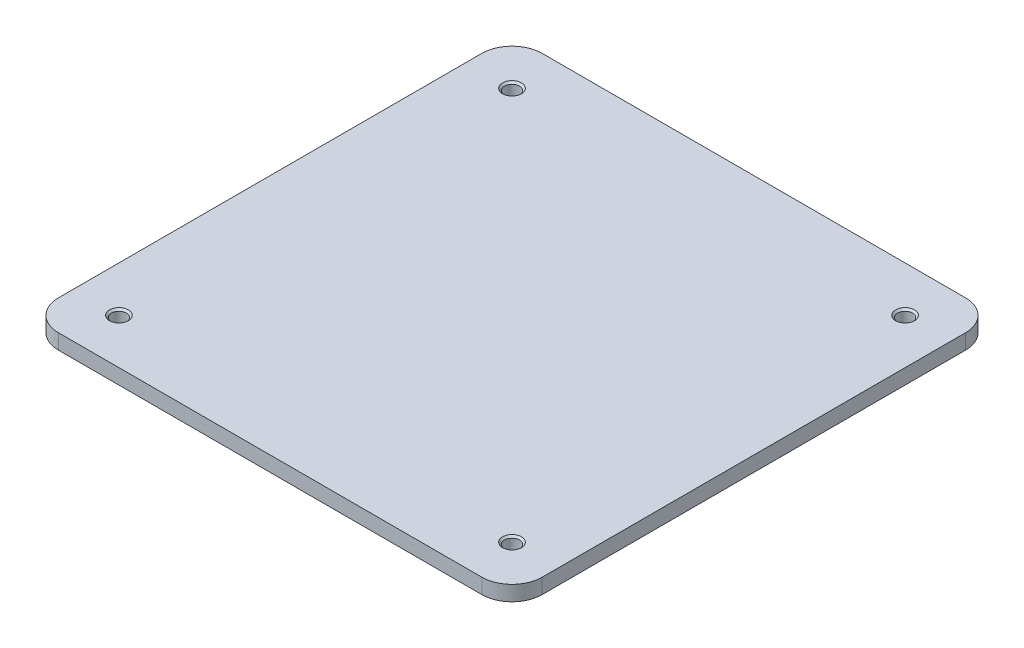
from build123d import *

# Parameters (mm, degrees)
SKETCH1_W           = 203.2
SKETCH1_H           = 203.2
BOSS_EXTRUDE1_DEPTH = 6.35
SKETCH2_R           = 3.175
CUT_EXTRUDE1_DEPTH  = 144.824345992
CHAMFER1_SIZE       = 0.79375
FILLET1_R           = 12.7


with BuildPart() as part:
    # Sketch1 → Boss-Extrude1 (new body)
    with BuildSketch(Plane(origin=(0, 0, 0), x_dir=(1, 0, 0), z_dir=(0, 1, 0))):
        Rectangle(SKETCH1_W, SKETCH1_H)
    extrude(amount=BOSS_EXTRUDE1_DEPTH)

    # Sketch2 → Cut-Extrude1 (cut, through all)
    with BuildSketch(Plane(origin=(0, 6.35, 0), x_dir=(1, 0, 0), z_dir=(0, 1, 0))):
        with Locations(Location((-82.55, 82.55, 0), (0, 0, 270))):
            Circle(SKETCH2_R)
        with Locations(Location((82.55, 82.55, 0), (0, 0, 270))):
            Circle(SKETCH2_R)
        with Locations(Location((82.55, -82.55, 0), (0, 0, 270))):
            Circle(SKETCH2_R)
        with Locations(Location((-82.55, -82.55, 0), (0, 0, 270))):
            Circle(SKETCH2_R)
    extrude(amount=-CUT_EXTRUDE1_DEPTH, mode=Mode.SUBTRACT)

    # Chamfer1
    chamfer1_edges = [part.edges().sort_by_distance(p)[0] for p in [
        (-82.55, 6.35, 79.375),
        (82.55, 6.35, 79.375),
        (82.55, 6.35, -85.725),
        (-82.55, 6.35, -85.725),
    ]]
    chamfer(chamfer1_edges, length=CHAMFER1_SIZE)

    # Fillet1
    fillet1_edges = [part.edges().sort_by_distance(p)[0] for p in [
        (101.6, 3.175, 101.6),
        (-101.6, 3.175, 101.6),
        (-101.6, 3.175, -101.6),
        (101.6, 3.175, -101.6),
    ]]
    fillet(fillet1_edges, radius=FILLET1_R)


solid = part.part
